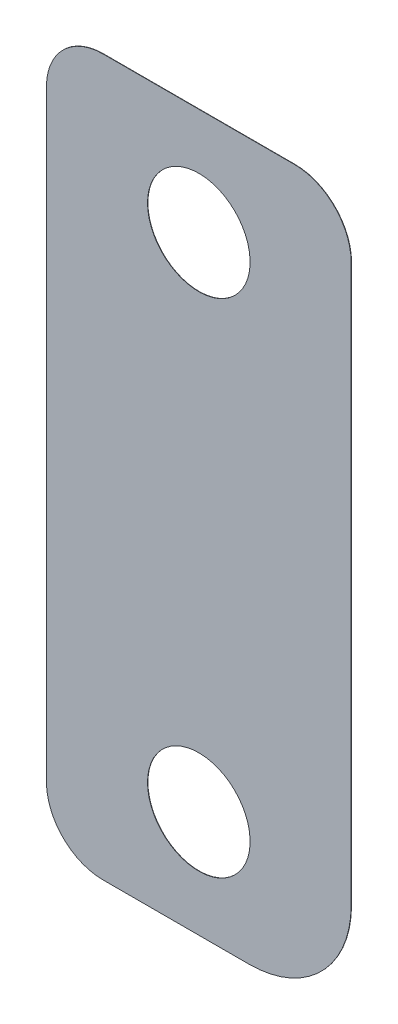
from build123d import *

# Parameters (mm, degrees)
BOSS_EXTRUDE1_DEPTH = 0.0254
HOLE1_D             = 7.1374


with BuildPart() as part:
    # Sketch2 → Boss-Extrude1 (new body)
    with BuildSketch(Plane(origin=(0, 0, 71.9328), x_dir=(-1, 0, 0), z_dir=(0, 0, -1))):
        with BuildLine():
            Line((767.746295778, -6.058406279), (754.411295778, -6.058406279))
            ThreePointArc((754.411295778, -6.058406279), (751.627416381, -7.211526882), (750.474295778, -9.995406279))
            Line((750.474295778, -9.995406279), (750.474295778, -48.730406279))
            ThreePointArc((750.474295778, -48.730406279), (752.557352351, -53.759349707), (757.586295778, -55.842406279))
            Line((757.586295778, -55.842406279), (767.746295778, -55.842406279))
            ThreePointArc((767.746295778, -55.842406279), (770.530175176, -54.689285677), (771.683295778, -51.905406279))
            Line((771.683295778, -51.905406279), (771.683295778, -9.995406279))
            ThreePointArc((771.683295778, -9.995406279), (770.530175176, -7.211526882), (767.746295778, -6.058406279))
        make_face()
    extrude(amount=-BOSS_EXTRUDE1_DEPTH)

    # Hole1 (through all)
    with Locations(Plane(origin=(-757.424535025, -6.061765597, 71.9328), x_dir=(-1, 0, 0), z_dir=(0, 0, -1))):
        with Locations((3.654260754, -7.426140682), (3.654260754, -42.351140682)):
            Hole(HOLE1_D / 2)


solid = part.part
